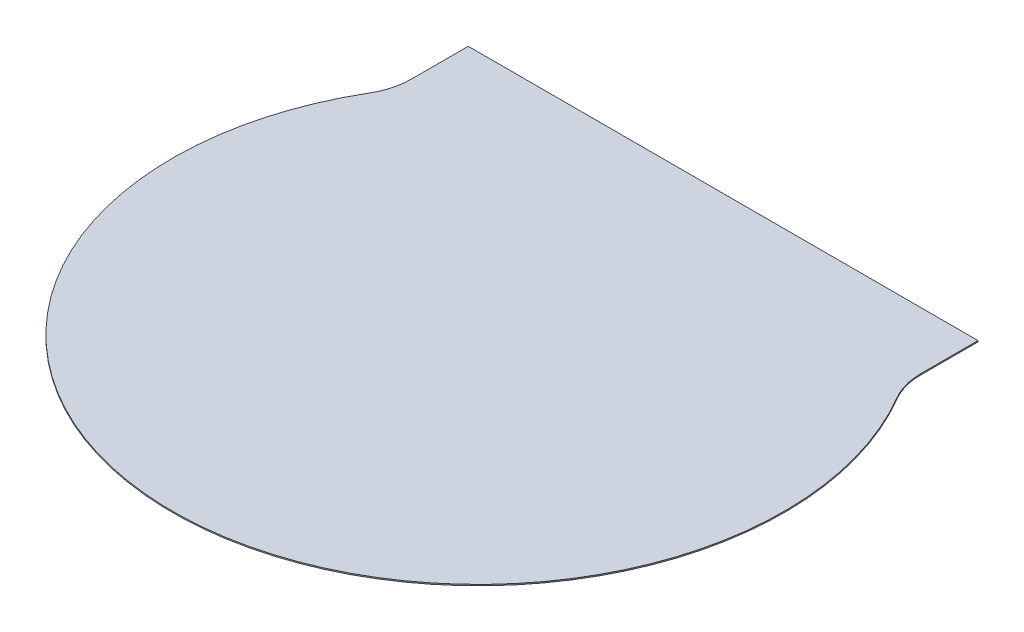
from build123d import *

# Parameters (mm, degrees)
EXTRUDE1_DEPTH = 0.015


with BuildPart() as part:
    # Sketch1 → Extrude1 (new body)
    with BuildSketch(Plane(origin=(0, 0, 0), x_dir=(1, 0, 0), z_dir=(0, 1, 0))):
        with BuildLine():
            ThreePointArc((3.175, 2.338317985), (3.203408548, 2.125306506), (3.286648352, 1.927185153))
            ThreePointArc((3.286648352, 1.927185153), (0, -3.81), (-3.286648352, 1.927185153))
            ThreePointArc((-3.286648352, 1.927185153), (-3.203408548, 2.125306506), (-3.175, 2.338317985))
            Line((-3.175, 2.338317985), (-3.175, 3.048))
            Line((-3.175, 3.048), (3.175, 3.048))
            Line((3.175, 3.048), (3.175, 2.338317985))
        make_face()
    extrude(amount=EXTRUDE1_DEPTH)


solid = part.part
